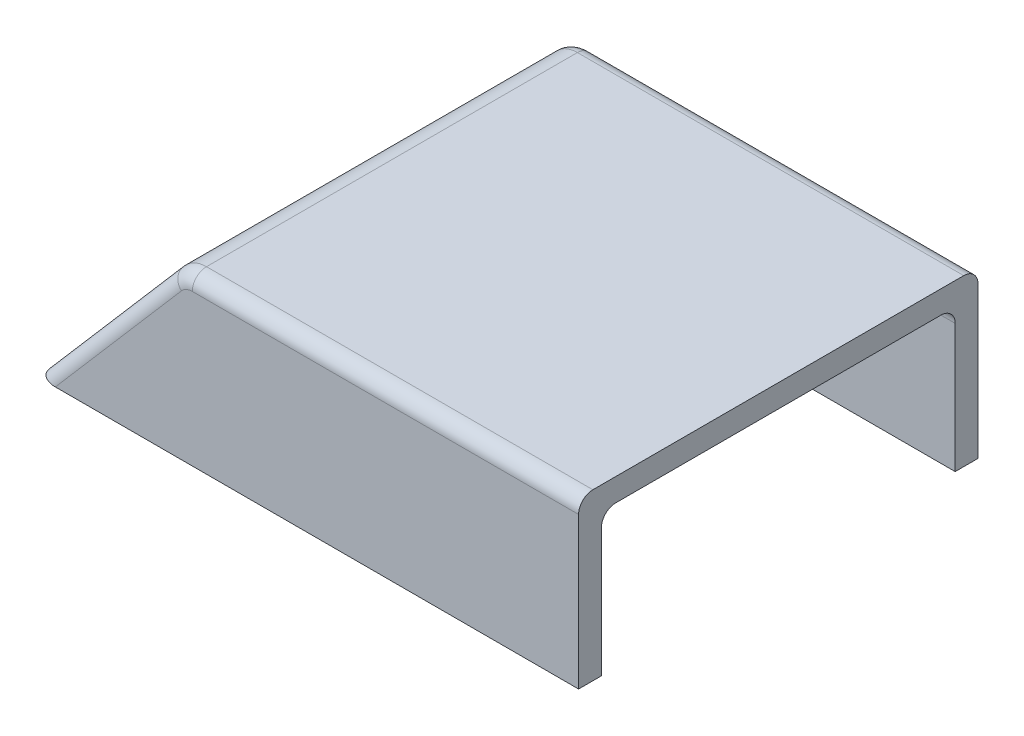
ISO-10303-21;
HEADER;
FILE_DESCRIPTION(('STEP AP214'),'2;1');
FILE_NAME('part.step','',(''),(''),'','','');
FILE_SCHEMA(('AUTOMOTIVE_DESIGN { 1 0 10303 214 1 1 1 1 }'));
ENDSEC;
DATA;
#1=APPLICATION_CONTEXT('core data for automotive mechanical design processes');
#2=APPLICATION_PROTOCOL_DEFINITION('international standard','automotive_design',2000,#1);
#3=PRODUCT_CONTEXT('',#1,'mechanical');
#4=PRODUCT('Part','Part','',(#3));
#5=PRODUCT_RELATED_PRODUCT_CATEGORY('part','',(#4));
#6=PRODUCT_DEFINITION_FORMATION('','',#4);
#7=PRODUCT_DEFINITION_CONTEXT('part definition',#1,'design');
#8=PRODUCT_DEFINITION('design','',#6,#7);
#9=PRODUCT_DEFINITION_SHAPE('','',#8);
#10=(LENGTH_UNIT() NAMED_UNIT(*) SI_UNIT(.MILLI.,.METRE.));
#11=(NAMED_UNIT(*) PLANE_ANGLE_UNIT() SI_UNIT($,.RADIAN.));
#12=(NAMED_UNIT(*) SI_UNIT($,.STERADIAN.) SOLID_ANGLE_UNIT());
#13=UNCERTAINTY_MEASURE_WITH_UNIT(LENGTH_MEASURE(1.E-05),#10,'distance_accuracy_value','');
#14=(GEOMETRIC_REPRESENTATION_CONTEXT(3) GLOBAL_UNCERTAINTY_ASSIGNED_CONTEXT((#13)) GLOBAL_UNIT_ASSIGNED_CONTEXT((#10,
#11,#12)) REPRESENTATION_CONTEXT('',''));
#15=CARTESIAN_POINT('',(0.,0.,0.));
#16=DIRECTION('',(0.,0.,1.));
#17=DIRECTION('',(1.,0.,0.));
#18=AXIS2_PLACEMENT_3D('',#15,#16,#17);
#19=CARTESIAN_POINT('',(-50.,-58.,70.));
#20=DIRECTION('',(0.757409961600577,-0.652939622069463,0.));
#21=DIRECTION('',(0.652939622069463,0.757409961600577,0.));
#22=AXIS2_PLACEMENT_3D('',#19,#20,#21);
#23=PLANE('',#22);
#24=DIRECTION('',(0.,0.,-1.));
#25=VECTOR('',#24,1.);
#26=CARTESIAN_POINT('',(-2.99189980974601,-3.47060377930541,70.));
#27=LINE('',#26,#25);
#28=CARTESIAN_POINT('',(-2.99189980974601,-3.47060377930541,65.));
#29=VERTEX_POINT('',#28);
#30=CARTESIAN_POINT('',(-2.99189980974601,-3.47060377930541,-65.));
#31=VERTEX_POINT('',#30);
#32=EDGE_CURVE('E289',#29,#31,#27,.T.);
#33=ORIENTED_EDGE('',*,*,#32,.T.);
#34=DIRECTION('',(-0.652939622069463,-0.757409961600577,0.));
#35=VECTOR('',#34,1.);
#36=CARTESIAN_POINT('',(-50.,-58.,-65.));
#37=LINE('',#36,#35);
#38=CARTESIAN_POINT('',(-50.,-58.,-65.));
#39=VERTEX_POINT('',#38);
#40=EDGE_CURVE('E275',#31,#39,#37,.T.);
#41=ORIENTED_EDGE('',*,*,#40,.T.);
#42=DIRECTION('',(0.,0.,-1.));
#43=VECTOR('',#42,1.);
#44=CARTESIAN_POINT('',(-50.,-58.,70.));
#45=LINE('',#44,#43);
#46=CARTESIAN_POINT('',(-50.,-58.,65.));
#47=VERTEX_POINT('',#46);
#48=EDGE_CURVE('E292',#47,#39,#45,.T.);
#49=ORIENTED_EDGE('',*,*,#48,.F.);
#50=DIRECTION('',(-0.652939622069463,-0.757409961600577,0.));
#51=VECTOR('',#50,1.);
#52=CARTESIAN_POINT('',(-50.,-58.,65.));
#53=LINE('',#52,#51);
#54=EDGE_CURVE('E273',#47,#29,#53,.F.);
#55=ORIENTED_EDGE('',*,*,#54,.T.);
#56=EDGE_LOOP('',(#33,#41,#49,#55));
#57=FACE_BOUND('',#56,.T.);
#58=ADVANCED_FACE('F41',(#57),#23,.F.);
#59=CARTESIAN_POINT('',(140.,-58.,70.));
#60=DIRECTION('',(0.,1.,0.));
#61=DIRECTION('',(-1.,0.,0.));
#62=AXIS2_PLACEMENT_3D('',#59,#60,#61);
#63=PLANE('',#62);
#64=ORIENTED_EDGE('',*,*,#48,.T.);
#65=CARTESIAN_POINT('',(-43.3985552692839,-58.,-65.));
#66=DIRECTION('',(0.,1.,0.));
#67=DIRECTION('',(-1.,0.,0.));
#68=AXIS2_PLACEMENT_3D('',#65,#66,#67);
#69=ELLIPSE('',#68,6.60144473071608,5.);
#70=CARTESIAN_POINT('',(-43.3985552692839,-58.,-70.));
#71=VERTEX_POINT('',#70);
#72=EDGE_CURVE('E324',#39,#71,#69,.F.);
#73=ORIENTED_EDGE('',*,*,#72,.T.);
#74=DIRECTION('',(1.,0.,0.));
#75=VECTOR('',#74,1.);
#76=CARTESIAN_POINT('',(-50.,-58.,-70.));
#77=LINE('',#76,#75);
#78=CARTESIAN_POINT('',(140.,-58.,-70.));
#79=VERTEX_POINT('',#78);
#80=EDGE_CURVE('E177',#71,#79,#77,.T.);
#81=ORIENTED_EDGE('',*,*,#80,.T.);
#82=DIRECTION('',(0.,0.,1.));
#83=VECTOR('',#82,1.);
#84=CARTESIAN_POINT('',(140.,-58.,-70.));
#85=LINE('',#84,#83);
#86=CARTESIAN_POINT('',(140.,-58.,-62.));
#87=VERTEX_POINT('',#86);
#88=EDGE_CURVE('E173',#79,#87,#85,.T.);
#89=ORIENTED_EDGE('',*,*,#88,.T.);
#90=DIRECTION('',(1.,0.,0.));
#91=VECTOR('',#90,1.);
#92=CARTESIAN_POINT('',(-50.,-58.,-62.));
#93=LINE('',#92,#91);
#94=CARTESIAN_POINT('',(-32.8362437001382,-58.,-62.));
#95=VERTEX_POINT('',#94);
#96=EDGE_CURVE('E160',#95,#87,#93,.T.);
#97=ORIENTED_EDGE('',*,*,#96,.F.);
#98=CARTESIAN_POINT('',(-32.8362437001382,-58.,-57.0000000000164));
#99=DIRECTION('',(0.,1.,0.));
#100=DIRECTION('',(1.,0.,0.));
#101=AXIS2_PLACEMENT_3D('',#98,#99,#100);
#102=ELLIPSE('',#101,6.60144473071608,5.);
#103=CARTESIAN_POINT('',(-39.4376884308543,-58.,-57.0000000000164));
#104=VERTEX_POINT('',#103);
#105=EDGE_CURVE('E205',#95,#104,#102,.T.);
#106=ORIENTED_EDGE('',*,*,#105,.T.);
#107=DIRECTION('',(0.,0.,-1.));
#108=VECTOR('',#107,1.);
#109=CARTESIAN_POINT('',(-39.4376884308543,-58.0000000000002,500000.));
#110=LINE('',#109,#108);
#111=CARTESIAN_POINT('',(-39.4376884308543,-58.,57.0000000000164));
#112=VERTEX_POINT('',#111);
#113=EDGE_CURVE('E179',#112,#104,#110,.T.);
#114=ORIENTED_EDGE('',*,*,#113,.F.);
#115=CARTESIAN_POINT('',(-32.8362437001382,-58.,57.0000000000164));
#116=DIRECTION('',(0.,1.,0.));
#117=DIRECTION('',(-1.,0.,0.));
#118=AXIS2_PLACEMENT_3D('',#115,#116,#117);
#119=ELLIPSE('',#118,6.60144473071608,5.);
#120=CARTESIAN_POINT('',(-32.8362437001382,-58.,62.));
#121=VERTEX_POINT('',#120);
#122=EDGE_CURVE('E208',#112,#121,#119,.T.);
#123=ORIENTED_EDGE('',*,*,#122,.T.);
#124=DIRECTION('',(1.,0.,0.));
#125=VECTOR('',#124,1.);
#126=CARTESIAN_POINT('',(140.,-58.,62.));
#127=LINE('',#126,#125);
#128=CARTESIAN_POINT('',(140.,-58.,62.));
#129=VERTEX_POINT('',#128);
#130=EDGE_CURVE('E216',#121,#129,#127,.T.);
#131=ORIENTED_EDGE('',*,*,#130,.T.);
#132=DIRECTION('',(0.,0.,-1.));
#133=VECTOR('',#132,1.);
#134=CARTESIAN_POINT('',(140.,-58.,70.));
#135=LINE('',#134,#133);
#136=CARTESIAN_POINT('',(140.,-58.,70.));
#137=VERTEX_POINT('',#136);
#138=EDGE_CURVE('E294',#137,#129,#135,.T.);
#139=ORIENTED_EDGE('',*,*,#138,.F.);
#140=DIRECTION('',(1.,0.,0.));
#141=VECTOR('',#140,1.);
#142=CARTESIAN_POINT('',(140.,-58.,70.));
#143=LINE('',#142,#141);
#144=CARTESIAN_POINT('',(-43.3985552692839,-58.,70.));
#145=VERTEX_POINT('',#144);
#146=EDGE_CURVE('E285',#145,#137,#143,.T.);
#147=ORIENTED_EDGE('',*,*,#146,.F.);
#148=CARTESIAN_POINT('',(-43.3985552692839,-58.,65.));
#149=DIRECTION('',(0.,1.,0.));
#150=DIRECTION('',(-1.,0.,0.));
#151=AXIS2_PLACEMENT_3D('',#148,#149,#150);
#152=ELLIPSE('',#151,6.60144473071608,5.);
#153=EDGE_CURVE('E277',#145,#47,#152,.F.);
#154=ORIENTED_EDGE('',*,*,#153,.T.);
#155=EDGE_LOOP('',(#64,#73,#81,#89,#97,#106,#114,#123,#131,#139,#147,#154));
#156=FACE_BOUND('',#155,.T.);
#157=ADVANCED_FACE('F175',(#156),#63,.F.);
#158=CARTESIAN_POINT('',(140.,-1.11022302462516E-13,70.));
#159=DIRECTION('',(-1.,0.,0.));
#160=DIRECTION('',(0.,0.,1.));
#161=AXIS2_PLACEMENT_3D('',#158,#159,#160);
#162=PLANE('',#161);
#163=DIRECTION('',(0.,1.,0.));
#164=VECTOR('',#163,1.);
#165=CARTESIAN_POINT('',(140.,-58.,-70.));
#166=LINE('',#165,#164);
#167=CARTESIAN_POINT('',(140.,-5.00000000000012,-70.));
#168=VERTEX_POINT('',#167);
#169=EDGE_CURVE('E180',#79,#168,#166,.T.);
#170=ORIENTED_EDGE('',*,*,#169,.T.);
#171=CARTESIAN_POINT('',(140.,-5.,-65.));
#172=DIRECTION('',(-1.,0.,0.));
#173=DIRECTION('',(0.,0.,1.));
#174=AXIS2_PLACEMENT_3D('',#171,#172,#173);
#175=CIRCLE('',#174,5.);
#176=CARTESIAN_POINT('',(140.,0.,-65.));
#177=VERTEX_POINT('',#176);
#178=EDGE_CURVE('E55',#168,#177,#175,.F.);
#179=ORIENTED_EDGE('',*,*,#178,.T.);
#180=DIRECTION('',(0.,0.,-1.));
#181=VECTOR('',#180,1.);
#182=CARTESIAN_POINT('',(140.,-1.11022302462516E-13,70.));
#183=LINE('',#182,#181);
#184=CARTESIAN_POINT('',(140.,-1.11022302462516E-13,65.));
#185=VERTEX_POINT('',#184);
#186=EDGE_CURVE('E296',#185,#177,#183,.T.);
#187=ORIENTED_EDGE('',*,*,#186,.F.);
#188=CARTESIAN_POINT('',(140.,-5.00000000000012,65.));
#189=DIRECTION('',(-1.,0.,0.));
#190=DIRECTION('',(0.,0.,1.));
#191=AXIS2_PLACEMENT_3D('',#188,#189,#190);
#192=CIRCLE('',#191,5.);
#193=CARTESIAN_POINT('',(140.,-5.00000000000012,70.));
#194=VERTEX_POINT('',#193);
#195=EDGE_CURVE('E206',#185,#194,#192,.F.);
#196=ORIENTED_EDGE('',*,*,#195,.T.);
#197=DIRECTION('',(0.,1.,0.));
#198=VECTOR('',#197,1.);
#199=CARTESIAN_POINT('',(140.,-1.11022302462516E-13,70.));
#200=LINE('',#199,#198);
#201=EDGE_CURVE('E297',#137,#194,#200,.T.);
#202=ORIENTED_EDGE('',*,*,#201,.F.);
#203=ORIENTED_EDGE('',*,*,#138,.T.);
#204=DIRECTION('',(0.,1.,0.));
#205=VECTOR('',#204,1.);
#206=CARTESIAN_POINT('',(140.,-1.11022302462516E-13,62.));
#207=LINE('',#206,#205);
#208=CARTESIAN_POINT('',(140.,-13.0000000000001,62.));
#209=VERTEX_POINT('',#208);
#210=EDGE_CURVE('E229',#129,#209,#207,.T.);
#211=ORIENTED_EDGE('',*,*,#210,.T.);
#212=CARTESIAN_POINT('',(140.,-13.0000000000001,57.0000000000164));
#213=DIRECTION('',(-1.,0.,0.));
#214=DIRECTION('',(0.,0.,1.));
#215=AXIS2_PLACEMENT_3D('',#212,#213,#214);
#216=CIRCLE('',#215,5.);
#217=CARTESIAN_POINT('',(140.,-8.00000000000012,57.0000000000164));
#218=VERTEX_POINT('',#217);
#219=EDGE_CURVE('E11',#209,#218,#216,.T.);
#220=ORIENTED_EDGE('',*,*,#219,.T.);
#221=DIRECTION('',(0.,0.,-1.));
#222=VECTOR('',#221,1.);
#223=CARTESIAN_POINT('',(140.,-8.00000000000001,500000.));
#224=LINE('',#223,#222);
#225=CARTESIAN_POINT('',(140.,-8.00000000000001,-57.0000000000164));
#226=VERTEX_POINT('',#225);
#227=EDGE_CURVE('E230',#218,#226,#224,.T.);
#228=ORIENTED_EDGE('',*,*,#227,.T.);
#229=CARTESIAN_POINT('',(140.,-13.,-57.0000000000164));
#230=DIRECTION('',(-1.,0.,0.));
#231=DIRECTION('',(0.,0.,1.));
#232=AXIS2_PLACEMENT_3D('',#229,#230,#231);
#233=CIRCLE('',#232,5.);
#234=CARTESIAN_POINT('',(140.,-13.0000000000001,-62.));
#235=VERTEX_POINT('',#234);
#236=EDGE_CURVE('E48',#226,#235,#233,.T.);
#237=ORIENTED_EDGE('',*,*,#236,.T.);
#238=DIRECTION('',(0.,1.,0.));
#239=VECTOR('',#238,1.);
#240=CARTESIAN_POINT('',(140.,-58.,-62.));
#241=LINE('',#240,#239);
#242=EDGE_CURVE('E164',#87,#235,#241,.T.);
#243=ORIENTED_EDGE('',*,*,#242,.F.);
#244=ORIENTED_EDGE('',*,*,#88,.F.);
#245=EDGE_LOOP('',(#170,#179,#187,#196,#202,#203,#211,#220,#228,#237,#243,#244));
#246=FACE_BOUND('',#245,.T.);
#247=ADVANCED_FACE('F182',(#246),#162,.F.);
#248=CARTESIAN_POINT('',(0.,-1.11022302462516E-13,70.));
#249=DIRECTION('',(0.,-1.,0.));
#250=DIRECTION('',(0.,0.,-1.));
#251=AXIS2_PLACEMENT_3D('',#248,#249,#250);
#252=PLANE('',#251);
#253=ORIENTED_EDGE('',*,*,#186,.T.);
#254=DIRECTION('',(-1.,0.,0.));
#255=VECTOR('',#254,1.);
#256=CARTESIAN_POINT('',(0.,0.,-65.));
#257=LINE('',#256,#255);
#258=CARTESIAN_POINT('',(4.58219980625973,0.,-65.));
#259=VERTEX_POINT('',#258);
#260=EDGE_CURVE('E204',#177,#259,#257,.T.);
#261=ORIENTED_EDGE('',*,*,#260,.T.);
#262=DIRECTION('',(0.,0.,-1.));
#263=VECTOR('',#262,1.);
#264=CARTESIAN_POINT('',(4.58219980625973,-1.11022302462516E-13,70.));
#265=LINE('',#264,#263);
#266=CARTESIAN_POINT('',(4.58219980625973,-1.11022302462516E-13,65.));
#267=VERTEX_POINT('',#266);
#268=EDGE_CURVE('E263',#259,#267,#265,.F.);
#269=ORIENTED_EDGE('',*,*,#268,.T.);
#270=DIRECTION('',(-1.,0.,0.));
#271=VECTOR('',#270,1.);
#272=CARTESIAN_POINT('',(0.,-1.11022302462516E-13,65.));
#273=LINE('',#272,#271);
#274=EDGE_CURVE('E62',#267,#185,#273,.F.);
#275=ORIENTED_EDGE('',*,*,#274,.T.);
#276=EDGE_LOOP('',(#253,#261,#269,#275));
#277=FACE_BOUND('',#276,.T.);
#278=ADVANCED_FACE('F372',(#277),#252,.F.);
#279=CARTESIAN_POINT('',(0.,-1.11022302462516E-13,70.));
#280=DIRECTION('',(0.,0.,-1.));
#281=DIRECTION('',(-1.,0.,0.));
#282=AXIS2_PLACEMENT_3D('',#279,#280,#281);
#283=PLANE('',#282);
#284=CARTESIAN_POINT('',(4.58219980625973,-10.0000000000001,70.));
#285=DIRECTION('',(0.,0.,-1.));
#286=DIRECTION('',(-1.,0.,0.));
#287=AXIS2_PLACEMENT_3D('',#284,#285,#286);
#288=CIRCLE('',#287,5.);
#289=CARTESIAN_POINT('',(4.58219980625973,-5.00000000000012,70.));
#290=VERTEX_POINT('',#289);
#291=CARTESIAN_POINT('',(0.795149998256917,-6.73530188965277,70.));
#292=VERTEX_POINT('',#291);
#293=EDGE_CURVE('E239',#290,#292,#288,.F.);
#294=ORIENTED_EDGE('',*,*,#293,.T.);
#295=DIRECTION('',(-0.652939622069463,-0.757409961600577,0.));
#296=VECTOR('',#295,1.);
#297=CARTESIAN_POINT('',(3.78704980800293,-3.26469811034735,70.));
#298=LINE('',#297,#296);
#299=EDGE_CURVE('E246',#292,#145,#298,.T.);
#300=ORIENTED_EDGE('',*,*,#299,.T.);
#301=ORIENTED_EDGE('',*,*,#146,.T.);
#302=ORIENTED_EDGE('',*,*,#201,.T.);
#303=DIRECTION('',(-1.,0.,0.));
#304=VECTOR('',#303,1.);
#305=CARTESIAN_POINT('',(0.,-5.00000000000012,70.));
#306=LINE('',#305,#304);
#307=EDGE_CURVE('E236',#194,#290,#306,.T.);
#308=ORIENTED_EDGE('',*,*,#307,.T.);
#309=EDGE_LOOP('',(#294,#300,#301,#302,#308));
#310=FACE_BOUND('',#309,.T.);
#311=ADVANCED_FACE('F303',(#310),#283,.F.);
#312=CARTESIAN_POINT('',(0.,-1.11022302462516E-13,62.));
#313=DIRECTION('',(0.,0.,-1.));
#314=DIRECTION('',(-1.,0.,0.));
#315=AXIS2_PLACEMENT_3D('',#312,#313,#314);
#316=PLANE('',#315);
#317=ORIENTED_EDGE('',*,*,#130,.F.);
#318=DIRECTION('',(-0.652939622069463,-0.757409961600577,0.));
#319=VECTOR('',#318,1.);
#320=CARTESIAN_POINT('',(9.84632950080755,-8.48821508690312,62.));
#321=LINE('',#320,#319);
#322=CARTESIAN_POINT('',(5.95685974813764,-13.0000000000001,62.));
#323=VERTEX_POINT('',#322);
#324=EDGE_CURVE('E226',#121,#323,#321,.F.);
#325=ORIENTED_EDGE('',*,*,#324,.T.);
#326=DIRECTION('',(-1.,0.,0.));
#327=VECTOR('',#326,1.);
#328=CARTESIAN_POINT('',(0.,-13.0000000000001,62.));
#329=LINE('',#328,#327);
#330=EDGE_CURVE('E237',#323,#209,#329,.F.);
#331=ORIENTED_EDGE('',*,*,#330,.T.);
#332=ORIENTED_EDGE('',*,*,#210,.F.);
#333=EDGE_LOOP('',(#317,#325,#331,#332));
#334=FACE_BOUND('',#333,.T.);
#335=ADVANCED_FACE('F225',(#334),#316,.T.);
#336=CARTESIAN_POINT('',(4.58219980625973,-10.0000000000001,70.));
#337=DIRECTION('',(0.,0.,-1.));
#338=DIRECTION('',(-1.,0.,0.));
#339=AXIS2_PLACEMENT_3D('',#336,#337,#338);
#340=CYLINDRICAL_SURFACE('',#339,10.);
#341=ORIENTED_EDGE('',*,*,#268,.F.);
#342=CARTESIAN_POINT('',(4.58219980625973,-10.,-65.));
#343=DIRECTION('',(0.,0.,1.));
#344=DIRECTION('',(1.,0.,0.));
#345=AXIS2_PLACEMENT_3D('',#342,#343,#344);
#346=CIRCLE('',#345,10.);
#347=EDGE_CURVE('E241',#259,#31,#346,.T.);
#348=ORIENTED_EDGE('',*,*,#347,.T.);
#349=ORIENTED_EDGE('',*,*,#32,.F.);
#350=CARTESIAN_POINT('',(4.58219980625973,-10.0000000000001,65.));
#351=DIRECTION('',(0.,0.,-1.));
#352=DIRECTION('',(-1.,0.,0.));
#353=AXIS2_PLACEMENT_3D('',#350,#351,#352);
#354=CIRCLE('',#353,10.);
#355=EDGE_CURVE('E318',#29,#267,#354,.T.);
#356=ORIENTED_EDGE('',*,*,#355,.T.);
#357=EDGE_LOOP('',(#341,#348,#349,#356));
#358=FACE_BOUND('',#357,.T.);
#359=ADVANCED_FACE('F335',(#358),#340,.T.);
#360=CARTESIAN_POINT('',(3.06737988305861,-8.69412075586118,500000.));
#361=DIRECTION('',(-0.757409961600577,0.652939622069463,0.));
#362=DIRECTION('',(-0.652939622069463,-0.757409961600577,0.));
#363=AXIS2_PLACEMENT_3D('',#360,#361,#362);
#364=PLANE('',#363);
#365=ORIENTED_EDGE('',*,*,#113,.T.);
#366=DIRECTION('',(0.652939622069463,0.757409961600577,0.));
#367=VECTOR('',#366,1.);
#368=CARTESIAN_POINT('',(3.06737988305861,-8.69412075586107,-57.0000000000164));
#369=LINE('',#368,#367);
#370=CARTESIAN_POINT('',(3.06737988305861,-8.69412075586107,-57.0000000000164));
#371=VERTEX_POINT('',#370);
#372=EDGE_CURVE('E262',#104,#371,#369,.T.);
#373=ORIENTED_EDGE('',*,*,#372,.T.);
#374=DIRECTION('',(0.,0.,-1.));
#375=VECTOR('',#374,1.);
#376=CARTESIAN_POINT('',(3.06737988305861,-8.69412075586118,500000.));
#377=LINE('',#376,#375);
#378=CARTESIAN_POINT('',(3.06737988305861,-8.69412075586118,57.0000000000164));
#379=VERTEX_POINT('',#378);
#380=EDGE_CURVE('E190',#379,#371,#377,.T.);
#381=ORIENTED_EDGE('',*,*,#380,.F.);
#382=DIRECTION('',(-0.652939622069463,-0.757409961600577,0.));
#383=VECTOR('',#382,1.);
#384=CARTESIAN_POINT('',(3.06737988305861,-8.69412075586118,57.0000000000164));
#385=LINE('',#384,#383);
#386=EDGE_CURVE('E260',#379,#112,#385,.T.);
#387=ORIENTED_EDGE('',*,*,#386,.T.);
#388=EDGE_LOOP('',(#365,#373,#381,#387));
#389=FACE_BOUND('',#388,.T.);
#390=ADVANCED_FACE('F363',(#389),#364,.F.);
#391=CARTESIAN_POINT('',(4.58219980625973,-10.0000000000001,500000.));
#392=DIRECTION('',(0.,0.,-1.));
#393=DIRECTION('',(-1.,0.,0.));
#394=AXIS2_PLACEMENT_3D('',#391,#392,#393);
#395=CYLINDRICAL_SURFACE('',#394,1.99999999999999);
#396=ORIENTED_EDGE('',*,*,#380,.T.);
#397=CARTESIAN_POINT('',(4.58219980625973,-10.,-57.0000000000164));
#398=DIRECTION('',(0.,0.,-1.));
#399=DIRECTION('',(-1.,0.,0.));
#400=AXIS2_PLACEMENT_3D('',#397,#398,#399);
#401=CIRCLE('',#400,1.99999999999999);
#402=CARTESIAN_POINT('',(4.58219980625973,-8.00000000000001,-57.0000000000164));
#403=VERTEX_POINT('',#402);
#404=EDGE_CURVE('E271',#371,#403,#401,.T.);
#405=ORIENTED_EDGE('',*,*,#404,.T.);
#406=DIRECTION('',(0.,0.,-1.));
#407=VECTOR('',#406,1.);
#408=CARTESIAN_POINT('',(4.58219980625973,-8.00000000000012,500000.));
#409=LINE('',#408,#407);
#410=CARTESIAN_POINT('',(4.58219980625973,-8.00000000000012,57.0000000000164));
#411=VERTEX_POINT('',#410);
#412=EDGE_CURVE('E252',#411,#403,#409,.T.);
#413=ORIENTED_EDGE('',*,*,#412,.F.);
#414=CARTESIAN_POINT('',(4.58219980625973,-10.0000000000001,57.0000000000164));
#415=DIRECTION('',(0.,0.,1.));
#416=DIRECTION('',(1.,0.,0.));
#417=AXIS2_PLACEMENT_3D('',#414,#415,#416);
#418=CIRCLE('',#417,1.99999999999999);
#419=EDGE_CURVE('E269',#411,#379,#418,.T.);
#420=ORIENTED_EDGE('',*,*,#419,.T.);
#421=EDGE_LOOP('',(#396,#405,#413,#420));
#422=FACE_BOUND('',#421,.T.);
#423=ADVANCED_FACE('F385',(#422),#395,.F.);
#424=CARTESIAN_POINT('',(140.,-8.00000000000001,500000.));
#425=DIRECTION('',(0.,1.,0.));
#426=DIRECTION('',(-1.,0.,0.));
#427=AXIS2_PLACEMENT_3D('',#424,#425,#426);
#428=PLANE('',#427);
#429=ORIENTED_EDGE('',*,*,#412,.T.);
#430=DIRECTION('',(1.,0.,0.));
#431=VECTOR('',#430,1.);
#432=CARTESIAN_POINT('',(140.,-8.00000000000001,-57.0000000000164));
#433=LINE('',#432,#431);
#434=EDGE_CURVE('E410',#403,#226,#433,.T.);
#435=ORIENTED_EDGE('',*,*,#434,.T.);
#436=ORIENTED_EDGE('',*,*,#227,.F.);
#437=DIRECTION('',(-1.,0.,0.));
#438=VECTOR('',#437,1.);
#439=CARTESIAN_POINT('',(140.,-8.00000000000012,57.0000000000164));
#440=LINE('',#439,#438);
#441=EDGE_CURVE('E249',#218,#411,#440,.T.);
#442=ORIENTED_EDGE('',*,*,#441,.T.);
#443=EDGE_LOOP('',(#429,#435,#436,#442));
#444=FACE_BOUND('',#443,.T.);
#445=ADVANCED_FACE('F361',(#444),#428,.F.);
#446=CARTESIAN_POINT('',(140.,-58.,-62.));
#447=DIRECTION('',(0.,0.,1.));
#448=DIRECTION('',(1.,0.,0.));
#449=AXIS2_PLACEMENT_3D('',#446,#447,#448);
#450=PLANE('',#449);
#451=DIRECTION('',(1.,0.,0.));
#452=VECTOR('',#451,1.);
#453=CARTESIAN_POINT('',(140.,-13.,-62.));
#454=LINE('',#453,#452);
#455=CARTESIAN_POINT('',(5.95685974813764,-13.,-62.));
#456=VERTEX_POINT('',#455);
#457=EDGE_CURVE('E265',#235,#456,#454,.F.);
#458=ORIENTED_EDGE('',*,*,#457,.T.);
#459=DIRECTION('',(0.652939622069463,0.757409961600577,0.));
#460=VECTOR('',#459,1.);
#461=CARTESIAN_POINT('',(40.8490580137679,27.4749499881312,-62.));
#462=LINE('',#461,#460);
#463=EDGE_CURVE('E167',#456,#95,#462,.F.);
#464=ORIENTED_EDGE('',*,*,#463,.T.);
#465=ORIENTED_EDGE('',*,*,#96,.T.);
#466=ORIENTED_EDGE('',*,*,#242,.T.);
#467=EDGE_LOOP('',(#458,#464,#465,#466));
#468=FACE_BOUND('',#467,.T.);
#469=ADVANCED_FACE('F162',(#468),#450,.T.);
#470=CARTESIAN_POINT('',(140.,-58.,-70.));
#471=DIRECTION('',(0.,0.,1.));
#472=DIRECTION('',(1.,0.,0.));
#473=AXIS2_PLACEMENT_3D('',#470,#471,#472);
#474=PLANE('',#473);
#475=ORIENTED_EDGE('',*,*,#80,.F.);
#476=DIRECTION('',(-0.652939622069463,-0.757409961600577,0.));
#477=VECTOR('',#476,1.);
#478=CARTESIAN_POINT('',(34.7897783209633,32.6984669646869,-70.));
#479=LINE('',#478,#477);
#480=CARTESIAN_POINT('',(0.795149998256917,-6.73530188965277,-70.));
#481=VERTEX_POINT('',#480);
#482=EDGE_CURVE('E329',#71,#481,#479,.F.);
#483=ORIENTED_EDGE('',*,*,#482,.T.);
#484=CARTESIAN_POINT('',(4.58219980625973,-10.,-70.));
#485=DIRECTION('',(0.,0.,1.));
#486=DIRECTION('',(1.,0.,0.));
#487=AXIS2_PLACEMENT_3D('',#484,#485,#486);
#488=CIRCLE('',#487,5.);
#489=CARTESIAN_POINT('',(4.58219980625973,-5.,-70.));
#490=VERTEX_POINT('',#489);
#491=EDGE_CURVE('E325',#481,#490,#488,.F.);
#492=ORIENTED_EDGE('',*,*,#491,.T.);
#493=DIRECTION('',(-1.,0.,0.));
#494=VECTOR('',#493,1.);
#495=CARTESIAN_POINT('',(140.,-5.,-70.));
#496=LINE('',#495,#494);
#497=EDGE_CURVE('E202',#490,#168,#496,.F.);
#498=ORIENTED_EDGE('',*,*,#497,.T.);
#499=ORIENTED_EDGE('',*,*,#169,.F.);
#500=EDGE_LOOP('',(#475,#483,#492,#498,#499));
#501=FACE_BOUND('',#500,.T.);
#502=ADVANCED_FACE('F350',(#501),#474,.F.);
#503=CARTESIAN_POINT('',(140.,-13.,-57.0000000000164));
#504=DIRECTION('',(1.,0.,0.));
#505=DIRECTION('',(0.,1.,0.));
#506=AXIS2_PLACEMENT_3D('',#503,#504,#505);
#507=CYLINDRICAL_SURFACE('',#506,5.);
#508=ORIENTED_EDGE('',*,*,#236,.F.);
#509=ORIENTED_EDGE('',*,*,#434,.F.);
#510=CARTESIAN_POINT('',(5.95685974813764,-13.,-57.0000000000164));
#511=DIRECTION('',(-0.964222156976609,-0.265095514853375,0.));
#512=DIRECTION('',(-0.265095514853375,0.964222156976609,0.));
#513=AXIS2_PLACEMENT_3D('',#510,#511,#512);
#514=ELLIPSE('',#513,5.18552696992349,5.);
#515=EDGE_CURVE('E170',#456,#403,#514,.F.);
#516=ORIENTED_EDGE('',*,*,#515,.F.);
#517=ORIENTED_EDGE('',*,*,#457,.F.);
#518=EDGE_LOOP('',(#508,#509,#516,#517));
#519=FACE_BOUND('',#518,.T.);
#520=ADVANCED_FACE('F352',(#519),#507,.F.);
#521=CARTESIAN_POINT('',(5.9568597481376,-13.,-62.0000000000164));
#522=CARTESIAN_POINT('',(5.9568597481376,-13.,-62.0000000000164));
#523=CARTESIAN_POINT('',(5.95685974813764,-13.,-62.0000000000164));
#524=CARTESIAN_POINT('',(5.83085139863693,-12.8122233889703,-62.0000296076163));
#525=CARTESIAN_POINT('',(5.86387568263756,-12.7970754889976,-62.0000170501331));
#526=CARTESIAN_POINT('',(5.89691171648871,-12.7819532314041,-62.0000296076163));
#527=CARTESIAN_POINT('',(5.70483132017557,-12.6244292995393,-61.9857369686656));
#528=CARTESIAN_POINT('',(5.77080125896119,-12.5939537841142,-61.9877099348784));
#529=CARTESIAN_POINT('',(5.83695810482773,-12.5638861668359,-61.9857369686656));
#530=CARTESIAN_POINT('',(5.45495013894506,-12.2520584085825,-61.9287954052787));
#531=CARTESIAN_POINT('',(5.58583997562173,-12.1903020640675,-61.938521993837));
#532=CARTESIAN_POINT('',(5.71807800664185,-12.1314879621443,-61.9287954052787));
#533=CARTESIAN_POINT('',(5.33108378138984,-12.0674737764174,-61.8862299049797));
#534=CARTESIAN_POINT('',(5.49377401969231,-11.9893811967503,-61.9016177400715));
#535=CARTESIAN_POINT('',(5.65914902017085,-11.9171477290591,-61.8862299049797));
#536=CARTESIAN_POINT('',(5.08762873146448,-11.7046790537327,-61.7733519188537));
#537=CARTESIAN_POINT('',(5.31186711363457,-11.5923952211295,-61.8031754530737));
#538=CARTESIAN_POINT('',(5.5433261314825,-11.4958693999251,-61.7733519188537));
#539=CARTESIAN_POINT('',(4.96801963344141,-11.5264385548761,-61.7031994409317));
#540=CARTESIAN_POINT('',(5.22185818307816,-11.3959635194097,-61.741595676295));
#541=CARTESIAN_POINT('',(5.48642252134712,-11.2888959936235,-61.7031994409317));
#542=CARTESIAN_POINT('',(4.73514500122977,-11.1794106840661,-61.5362820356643));
#543=CARTESIAN_POINT('',(5.0451708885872,-11.0103686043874,-61.5937641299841));
#544=CARTESIAN_POINT('',(5.37563322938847,-10.8859261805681,-61.5362820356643));
#545=CARTESIAN_POINT('',(4.62183554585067,-11.0105578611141,-61.4397397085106));
#546=CARTESIAN_POINT('',(4.9583461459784,-10.8208859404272,-61.5074646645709));
#547=CARTESIAN_POINT('',(5.32172665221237,-10.6898537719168,-61.4397397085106));
#548=CARTESIAN_POINT('',(4.40352368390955,-10.685231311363,-61.2216328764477));
#549=CARTESIAN_POINT('',(4.7892427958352,-10.4518419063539,-61.3102219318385));
#550=CARTESIAN_POINT('',(5.21786554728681,-10.3120835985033,-61.2216328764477));
#551=CARTESIAN_POINT('',(4.2984483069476,-10.5286488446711,-61.1003337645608));
#552=CARTESIAN_POINT('',(4.70684584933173,-10.2720222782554,-61.1992422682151));
#553=CARTESIAN_POINT('',(5.16787630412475,-10.1302595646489,-61.1003337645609));
#554=CARTESIAN_POINT('',(4.09843288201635,-10.2305874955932,-60.8347524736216));
#555=CARTESIAN_POINT('',(4.54795905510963,-9.92527442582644,-60.9528728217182));
#556=CARTESIAN_POINT('',(5.07271966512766,-9.78414982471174,-60.8347524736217));
#557=CARTESIAN_POINT('',(4.00338920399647,-10.0889541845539,-60.6907538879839));
#558=CARTESIAN_POINT('',(4.47138419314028,-9.75816066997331,-60.8174809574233));
#559=CARTESIAN_POINT('',(5.02750296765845,-9.61968479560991,-60.6907538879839));
#560=CARTESIAN_POINT('',(3.82509424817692,-9.82326050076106,-60.3822270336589));
#561=CARTESIAN_POINT('',(4.32566530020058,-9.44014989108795,-60.5229170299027));
#562=CARTESIAN_POINT('',(4.9426797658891,-9.31116048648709,-60.3822270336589));
#563=CARTESIAN_POINT('',(3.74171206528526,-9.69900505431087,-60.2179736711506));
#564=CARTESIAN_POINT('',(4.25647162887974,-9.28914453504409,-60.3638034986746));
#565=CARTESIAN_POINT('',(4.90301098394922,-9.16687468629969,-60.2179736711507));
#566=CARTESIAN_POINT('',(3.5881929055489,-9.47023205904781,-59.8717660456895));
#567=CARTESIAN_POINT('',(4.12718575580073,-9.00699648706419,-60.0230734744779));
#568=CARTESIAN_POINT('',(4.82997478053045,-8.90122279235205,-59.8717660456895));
#569=CARTESIAN_POINT('',(3.51790670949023,-9.36549214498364,-59.6900522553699));
#570=CARTESIAN_POINT('',(4.06707724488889,-8.87581820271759,-59.8416023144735));
#571=CARTESIAN_POINT('',(4.79653636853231,-8.77959848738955,-59.6900522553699));
#572=CARTESIAN_POINT('',(3.39179753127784,-9.17756527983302,-59.3120777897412));
#573=CARTESIAN_POINT('',(3.95771001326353,-8.63713975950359,-59.4583534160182));
#574=CARTESIAN_POINT('',(4.73654036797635,-8.56137724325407,-59.3120777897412));
#575=CARTESIAN_POINT('',(3.33582127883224,-9.09414992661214,-59.1160029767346));
#576=CARTESIAN_POINT('',(3.90846149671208,-8.52966186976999,-59.2568281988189));
#577=CARTESIAN_POINT('',(4.70990986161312,-8.46451508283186,-59.1160029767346));
#578=CARTESIAN_POINT('',(3.23928905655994,-8.95029839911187,-58.712725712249));
#579=CARTESIAN_POINT('',(3.82250637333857,-8.34207702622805,-58.8368082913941));
#580=CARTESIAN_POINT('',(4.66398499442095,-8.29747425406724,-58.7127257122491));
#581=CARTESIAN_POINT('',(3.19859378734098,-8.88965464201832,-58.5056444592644));
#582=CARTESIAN_POINT('',(3.78582538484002,-8.26202598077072,-58.6186811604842));
#583=CARTESIAN_POINT('',(4.64462436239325,-8.22705453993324,-58.5056444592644));
#584=CARTESIAN_POINT('',(3.1332996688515,-8.7923538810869,-58.083969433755));
#585=CARTESIAN_POINT('',(3.72645095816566,-8.13244973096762,-58.1700082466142));
#586=CARTESIAN_POINT('',(4.61356091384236,-8.11406860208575,-58.083969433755));
#587=CARTESIAN_POINT('',(3.10859435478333,-8.755538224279,-57.8694355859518));
#588=CARTESIAN_POINT('',(3.7037851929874,-8.08298491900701,-57.9399345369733));
#589=CARTESIAN_POINT('',(4.60180744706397,-8.07131815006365,-57.8694355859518));
#590=CARTESIAN_POINT('',(3.07566335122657,-8.70646471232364,-57.4365905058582));
#591=CARTESIAN_POINT('',(3.67343088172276,-8.01674094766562,-57.472972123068));
#592=CARTESIAN_POINT('',(4.58614063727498,-8.0143338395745,-57.4365905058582));
#593=CARTESIAN_POINT('',(3.06737988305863,-8.69412075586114,-57.2182952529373));
#594=CARTESIAN_POINT('',(3.66575984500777,-8.00000000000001,-57.2366291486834));
#595=CARTESIAN_POINT('',(4.58219980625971,-8.00000000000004,-57.2182952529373));
#596=CARTESIAN_POINT('',(3.06737988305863,-8.69412075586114,-56.7817047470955));
#597=CARTESIAN_POINT('',(3.66575984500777,-8.00000000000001,-56.7633708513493));
#598=CARTESIAN_POINT('',(4.58219980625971,-8.00000000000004,-56.7817047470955));
#599=CARTESIAN_POINT('',(3.07566335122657,-8.70646471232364,-56.5634094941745));
#600=CARTESIAN_POINT('',(3.67343088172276,-8.01674094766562,-56.5270278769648));
#601=CARTESIAN_POINT('',(4.58614063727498,-8.0143338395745,-56.5634094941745));
#602=CARTESIAN_POINT('',(3.10859435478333,-8.755538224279,-56.130564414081));
#603=CARTESIAN_POINT('',(3.7037851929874,-8.08298491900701,-56.0600654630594));
#604=CARTESIAN_POINT('',(4.60180744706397,-8.07131815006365,-56.130564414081));
#605=CARTESIAN_POINT('',(3.1332996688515,-8.7923538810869,-55.9160305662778));
#606=CARTESIAN_POINT('',(3.72645095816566,-8.13244973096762,-55.8299917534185));
#607=CARTESIAN_POINT('',(4.61356091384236,-8.11406860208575,-55.9160305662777));
#608=CARTESIAN_POINT('',(3.19859378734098,-8.88965464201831,-55.4943555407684));
#609=CARTESIAN_POINT('',(3.78582538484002,-8.26202598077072,-55.3813188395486));
#610=CARTESIAN_POINT('',(4.64462436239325,-8.22705453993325,-55.4943555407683));
#611=CARTESIAN_POINT('',(3.23928905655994,-8.95029839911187,-55.2872742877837));
#612=CARTESIAN_POINT('',(3.82250637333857,-8.34207702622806,-55.1631917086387));
#613=CARTESIAN_POINT('',(4.66398499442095,-8.29747425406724,-55.2872742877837));
#614=CARTESIAN_POINT('',(3.33582127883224,-9.09414992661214,-54.8839970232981));
#615=CARTESIAN_POINT('',(3.90846149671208,-8.52966186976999,-54.7431718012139));
#616=CARTESIAN_POINT('',(4.70990986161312,-8.46451508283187,-54.8839970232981));
#617=CARTESIAN_POINT('',(3.39179753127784,-9.17756527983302,-54.6879222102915));
#618=CARTESIAN_POINT('',(3.95771001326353,-8.63713975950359,-54.5416465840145));
#619=CARTESIAN_POINT('',(4.73654036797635,-8.56137724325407,-54.6879222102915));
#620=CARTESIAN_POINT('',(3.51790670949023,-9.36549214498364,-54.3099477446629));
#621=CARTESIAN_POINT('',(4.06707724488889,-8.87581820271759,-54.1583976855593));
#622=CARTESIAN_POINT('',(4.79653636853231,-8.77959848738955,-54.3099477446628));
#623=CARTESIAN_POINT('',(3.5881929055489,-9.47023205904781,-54.1282339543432));
#624=CARTESIAN_POINT('',(4.12718575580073,-9.00699648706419,-53.9769265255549));
#625=CARTESIAN_POINT('',(4.82997478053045,-8.90122279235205,-54.1282339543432));
#626=CARTESIAN_POINT('',(3.74171206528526,-9.69900505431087,-53.7820263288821));
#627=CARTESIAN_POINT('',(4.25647162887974,-9.28914453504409,-53.6361965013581));
#628=CARTESIAN_POINT('',(4.90301098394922,-9.16687468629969,-53.7820263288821));
#629=CARTESIAN_POINT('',(3.82509424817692,-9.82326050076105,-53.6177729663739));
#630=CARTESIAN_POINT('',(4.32566530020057,-9.44014989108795,-53.4770829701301));
#631=CARTESIAN_POINT('',(4.9426797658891,-9.31116048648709,-53.6177729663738));
#632=CARTESIAN_POINT('',(4.00338920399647,-10.0889541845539,-53.3092461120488));
#633=CARTESIAN_POINT('',(4.47138419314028,-9.75816066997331,-53.1825190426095));
#634=CARTESIAN_POINT('',(5.02750296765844,-9.6196847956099,-53.3092461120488));
#635=CARTESIAN_POINT('',(4.09843288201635,-10.2305874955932,-53.1652475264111));
#636=CARTESIAN_POINT('',(4.54795905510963,-9.92527442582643,-53.0471271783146));
#637=CARTESIAN_POINT('',(5.07271966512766,-9.78414982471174,-53.1652475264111));
#638=CARTESIAN_POINT('',(4.2984483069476,-10.5286488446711,-52.8996662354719));
#639=CARTESIAN_POINT('',(4.70684584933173,-10.2720222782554,-52.8007577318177));
#640=CARTESIAN_POINT('',(5.16787630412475,-10.1302595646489,-52.8996662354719));
#641=CARTESIAN_POINT('',(4.40352368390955,-10.685231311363,-52.778367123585));
#642=CARTESIAN_POINT('',(4.7892427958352,-10.4518419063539,-52.6897780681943));
#643=CARTESIAN_POINT('',(5.21786554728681,-10.3120835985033,-52.778367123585));
#644=CARTESIAN_POINT('',(4.62183554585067,-11.0105578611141,-52.5602602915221));
#645=CARTESIAN_POINT('',(4.9583461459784,-10.8208859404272,-52.4925353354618));
#646=CARTESIAN_POINT('',(5.32172665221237,-10.6898537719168,-52.5602602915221));
#647=CARTESIAN_POINT('',(4.73514500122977,-11.1794106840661,-52.4637179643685));
#648=CARTESIAN_POINT('',(5.0451708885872,-11.0103686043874,-52.4062358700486));
#649=CARTESIAN_POINT('',(5.37563322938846,-10.8859261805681,-52.4637179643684));
#650=CARTESIAN_POINT('',(4.96801963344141,-11.5264385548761,-52.2968005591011));
#651=CARTESIAN_POINT('',(5.22185818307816,-11.3959635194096,-52.2584043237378));
#652=CARTESIAN_POINT('',(5.48642252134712,-11.2888959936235,-52.296800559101));
#653=CARTESIAN_POINT('',(5.08762873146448,-11.7046790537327,-52.2266480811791));
#654=CARTESIAN_POINT('',(5.31186711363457,-11.5923952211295,-52.196824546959));
#655=CARTESIAN_POINT('',(5.54332613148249,-11.4958693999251,-52.2266480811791));
#656=CARTESIAN_POINT('',(5.33108378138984,-12.0674737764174,-52.113770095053));
#657=CARTESIAN_POINT('',(5.49377401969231,-11.9893811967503,-52.0983822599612));
#658=CARTESIAN_POINT('',(5.65914902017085,-11.9171477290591,-52.113770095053));
#659=CARTESIAN_POINT('',(5.45495013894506,-12.2520584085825,-52.0712045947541));
#660=CARTESIAN_POINT('',(5.58583997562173,-12.1903020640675,-52.0614780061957));
#661=CARTESIAN_POINT('',(5.71807800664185,-12.1314879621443,-52.071204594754));
#662=CARTESIAN_POINT('',(5.70483132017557,-12.6244292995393,-52.0142630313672));
#663=CARTESIAN_POINT('',(5.77080125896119,-12.5939537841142,-52.0122900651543));
#664=CARTESIAN_POINT('',(5.83695810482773,-12.5638861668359,-52.0142630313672));
#665=CARTESIAN_POINT('',(5.83085139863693,-12.8122233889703,-51.9999703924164));
#666=CARTESIAN_POINT('',(5.86387568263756,-12.7970754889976,-51.9999829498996));
#667=CARTESIAN_POINT('',(5.89691171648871,-12.7819532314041,-51.9999703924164));
#668=CARTESIAN_POINT('',(5.9568597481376,-13.,-52.0000000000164));
#669=CARTESIAN_POINT('',(5.9568597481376,-13.,-52.0000000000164));
#670=CARTESIAN_POINT('',(5.95685974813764,-13.,-52.0000000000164));
#671=(BOUNDED_SURFACE() B_SPLINE_SURFACE(3,2,((#521,#522,#523),(#524,#525,#526),(#527,#528,
#529),(#530,#531,#532),(#533,#534,#535),(#536,#537,#538),(#539,#540,#541),(#542,#543,#544),
(#545,#546,#547),(#548,#549,#550),(#551,#552,#553),(#554,#555,#556),(#557,#558,#559),(#560,#561,
#562),(#563,#564,#565),(#566,#567,#568),(#569,#570,#571),(#572,#573,#574),(#575,#576,#577),
(#578,#579,#580),(#581,#582,#583),(#584,#585,#586),(#587,#588,#589),(#590,#591,#592),(#593,#594,
#595),(#596,#597,#598),(#599,#600,#601),(#602,#603,#604),(#605,#606,#607),(#608,#609,#610),
(#611,#612,#613),(#614,#615,#616),(#617,#618,#619),(#620,#621,#622),(#623,#624,#625),(#626,#627,
#628),(#629,#630,#631),(#632,#633,#634),(#635,#636,#637),(#638,#639,#640),(#641,#642,#643),
(#644,#645,#646),(#647,#648,#649),(#650,#651,#652),(#653,#654,#655),(#656,#657,#658),(#659,#660,
#661),(#662,#663,#664),(#665,#666,#667),(#668,#669,#670)),.UNSPECIFIED.,.F.,.F.,
.F.) B_SPLINE_SURFACE_WITH_KNOTS((4,2,2,2,2,2,2,2,2,2,2,2,2,2,2,2,2,2,2,2,2,2,2,2,4),(3,3),(0.,
0.431494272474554,0.861720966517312,1.28948824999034,1.71375306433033,2.13368845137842,
2.54874171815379,2.95867939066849,3.36361442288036,3.76401107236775,4.16066364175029,
4.55464727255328,4.94724223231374,5.33983719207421,5.7338208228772,6.13047339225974,
6.53087004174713,6.935805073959,7.34574274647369,7.76079601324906,8.18073140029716,
8.60499621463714,9.03276349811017,9.46299019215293,9.89448446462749),(0.,1.),
.UNSPECIFIED.) GEOMETRIC_REPRESENTATION_ITEM() RATIONAL_B_SPLINE_SURFACE(((1.,1.,1.),(1.,
1.00000861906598,1.),(1.,0.999505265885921,1.),(1.,0.997538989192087,1.),(1.,0.99607888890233,
1.),(1.,0.99227372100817,1.),(1.,0.989933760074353,1.),(1.,0.984512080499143,1.),(1.,
0.981436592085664,1.),(1.,0.974734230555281,1.),(1.,0.971113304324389,1.),(1.,0.963553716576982,
1.),(1.,0.959619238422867,1.),(1.,0.951696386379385,1.),(1.,0.947709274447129,1.),(1.,
0.939959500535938,1.),(1.,0.936194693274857,1.),(1.,0.929162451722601,1.),(1.,0.925889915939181,
1.),(1.,0.920087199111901,1.),(1.,0.917550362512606,1.),(1.,0.913413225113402,1.),(1.,
0.911806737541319,1.),(1.,0.909653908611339,1.),(1.,0.909103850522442,1.),(1.,0.909103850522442,
1.),(1.,0.909653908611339,1.),(1.,0.911806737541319,1.),(1.,0.913413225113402,1.),(1.,
0.917550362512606,1.),(1.,0.920087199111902,1.),(1.,0.925889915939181,1.),(1.,0.929162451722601,
1.),(1.,0.936194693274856,1.),(1.,0.939959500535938,1.),(1.,0.94770927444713,1.),(1.,
0.951696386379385,1.),(1.,0.959619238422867,1.),(1.,0.963553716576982,1.),(1.,0.971113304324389,
1.),(1.,0.974734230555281,1.),(1.,0.981436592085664,1.),(1.,0.984512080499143,1.),(1.,
0.989933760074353,1.),(1.,0.99227372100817,1.),(1.,0.99607888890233,1.),(1.,0.997538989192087,
1.),(1.,0.999505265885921,1.),(1.,1.00000861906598,1.),(1.,1.,1.))) REPRESENTATION_ITEM('') SURFACE());
#672=ORIENTED_EDGE('',*,*,#515,.T.);
#673=ORIENTED_EDGE('',*,*,#404,.F.);
#674=CARTESIAN_POINT('',(5.95685974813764,-13.,-57.0000000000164));
#675=DIRECTION('',(-0.830364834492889,-0.557220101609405,0.));
#676=DIRECTION('',(-0.557220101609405,0.830364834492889,0.));
#677=AXIS2_PLACEMENT_3D('',#674,#675,#676);
#678=ELLIPSE('',#677,5.18552696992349,5.);
#679=EDGE_CURVE('E399',#456,#371,#678,.F.);
#680=ORIENTED_EDGE('',*,*,#679,.F.);
#681=EDGE_LOOP('',(#672,#673,#680));
#682=FACE_BOUND('',#681,.T.);
#683=ADVANCED_FACE('F358',(#682),#671,.F.);
#684=CARTESIAN_POINT('',(6.85442969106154,-11.9588188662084,-57.0000000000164));
#685=DIRECTION('',(0.652939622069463,0.757409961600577,0.));
#686=DIRECTION('',(-0.757409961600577,0.652939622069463,0.));
#687=AXIS2_PLACEMENT_3D('',#684,#685,#686);
#688=CYLINDRICAL_SURFACE('',#687,5.);
#689=ORIENTED_EDGE('',*,*,#105,.F.);
#690=ORIENTED_EDGE('',*,*,#463,.F.);
#691=ORIENTED_EDGE('',*,*,#679,.T.);
#692=ORIENTED_EDGE('',*,*,#372,.F.);
#693=EDGE_LOOP('',(#689,#690,#691,#692));
#694=FACE_BOUND('',#693,.T.);
#695=ADVANCED_FACE('F397',(#694),#688,.F.);
#696=CARTESIAN_POINT('',(0.,-5.,-65.));
#697=DIRECTION('',(-1.,0.,0.));
#698=DIRECTION('',(0.,0.,1.));
#699=AXIS2_PLACEMENT_3D('',#696,#697,#698);
#700=CYLINDRICAL_SURFACE('',#699,5.);
#701=ORIENTED_EDGE('',*,*,#178,.F.);
#702=ORIENTED_EDGE('',*,*,#497,.F.);
#703=CARTESIAN_POINT('',(4.58219980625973,-5.,-65.));
#704=DIRECTION('',(-1.,0.,0.));
#705=DIRECTION('',(0.,0.,1.));
#706=AXIS2_PLACEMENT_3D('',#703,#704,#705);
#707=CIRCLE('',#706,5.);
#708=EDGE_CURVE('E346',#259,#490,#707,.T.);
#709=ORIENTED_EDGE('',*,*,#708,.F.);
#710=ORIENTED_EDGE('',*,*,#260,.F.);
#711=EDGE_LOOP('',(#701,#702,#709,#710));
#712=FACE_BOUND('',#711,.T.);
#713=ADVANCED_FACE('F200',(#712),#700,.T.);
#714=CARTESIAN_POINT('',(4.58219980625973,-10.,-65.));
#715=DIRECTION('',(0.,0.,1.));
#716=DIRECTION('',(1.,0.,0.));
#717=AXIS2_PLACEMENT_3D('',#714,#715,#716);
#718=DEGENERATE_TOROIDAL_SURFACE('',#717,5.,5.,.T.);
#719=ORIENTED_EDGE('',*,*,#708,.T.);
#720=ORIENTED_EDGE('',*,*,#491,.F.);
#721=CARTESIAN_POINT('',(0.795149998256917,-6.73530188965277,-65.));
#722=DIRECTION('',(-0.652939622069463,-0.757409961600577,0.));
#723=DIRECTION('',(0.757409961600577,-0.652939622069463,0.));
#724=AXIS2_PLACEMENT_3D('',#721,#722,#723);
#725=CIRCLE('',#724,5.);
#726=EDGE_CURVE('E342',#31,#481,#725,.T.);
#727=ORIENTED_EDGE('',*,*,#726,.F.);
#728=ORIENTED_EDGE('',*,*,#347,.F.);
#729=EDGE_LOOP('',(#719,#720,#727,#728));
#730=FACE_BOUND('',#729,.T.);
#731=ADVANCED_FACE('F343',(#730),#718,.T.);
#732=CARTESIAN_POINT('',(-46.2129501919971,-61.2646981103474,-65.));
#733=DIRECTION('',(-0.652939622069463,-0.757409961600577,0.));
#734=DIRECTION('',(0.757409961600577,-0.652939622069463,0.));
#735=AXIS2_PLACEMENT_3D('',#732,#733,#734);
#736=CYLINDRICAL_SURFACE('',#735,5.);
#737=ORIENTED_EDGE('',*,*,#726,.T.);
#738=ORIENTED_EDGE('',*,*,#482,.F.);
#739=ORIENTED_EDGE('',*,*,#72,.F.);
#740=ORIENTED_EDGE('',*,*,#40,.F.);
#741=EDGE_LOOP('',(#737,#738,#739,#740));
#742=FACE_BOUND('',#741,.T.);
#743=ADVANCED_FACE('F349',(#742),#736,.T.);
#744=CARTESIAN_POINT('',(140.,-13.0000000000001,57.0000000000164));
#745=DIRECTION('',(-1.,0.,0.));
#746=DIRECTION('',(0.,-1.,0.));
#747=AXIS2_PLACEMENT_3D('',#744,#745,#746);
#748=CYLINDRICAL_SURFACE('',#747,5.);
#749=ORIENTED_EDGE('',*,*,#219,.F.);
#750=ORIENTED_EDGE('',*,*,#330,.F.);
#751=CARTESIAN_POINT('',(5.95685974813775,-13.0000000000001,57.0000000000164));
#752=DIRECTION('',(0.964222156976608,0.265095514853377,0.));
#753=DIRECTION('',(-0.265095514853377,0.964222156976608,0.));
#754=AXIS2_PLACEMENT_3D('',#751,#752,#753);
#755=ELLIPSE('',#754,5.18552696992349,5.);
#756=EDGE_CURVE('E347',#411,#323,#755,.T.);
#757=ORIENTED_EDGE('',*,*,#756,.F.);
#758=ORIENTED_EDGE('',*,*,#441,.F.);
#759=EDGE_LOOP('',(#749,#750,#757,#758));
#760=FACE_BOUND('',#759,.T.);
#761=ADVANCED_FACE('F431',(#760),#748,.F.);
#762=CARTESIAN_POINT('',(5.95685974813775,-13.0000000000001,62.0000000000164));
#763=CARTESIAN_POINT('',(5.95685974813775,-13.0000000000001,62.0000000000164));
#764=CARTESIAN_POINT('',(5.95685974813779,-13.0000000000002,62.0000000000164));
#765=CARTESIAN_POINT('',(5.89691171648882,-12.7819532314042,62.0000296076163));
#766=CARTESIAN_POINT('',(5.86387568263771,-12.7970754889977,62.0000170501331));
#767=CARTESIAN_POINT('',(5.83085139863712,-12.8122233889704,62.0000296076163));
#768=CARTESIAN_POINT('',(5.83695810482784,-12.563886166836,61.9857369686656));
#769=CARTESIAN_POINT('',(5.77080125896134,-12.5939537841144,61.9877099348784));
#770=CARTESIAN_POINT('',(5.70483132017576,-12.6244292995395,61.9857369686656));
#771=CARTESIAN_POINT('',(5.71807800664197,-12.1314879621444,61.9287954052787));
#772=CARTESIAN_POINT('',(5.58583997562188,-12.1903020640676,61.938521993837));
#773=CARTESIAN_POINT('',(5.45495013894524,-12.2520584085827,61.9287954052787));
#774=CARTESIAN_POINT('',(5.65914902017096,-11.9171477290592,61.8862299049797));
#775=CARTESIAN_POINT('',(5.49377401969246,-11.9893811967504,61.9016177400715));
#776=CARTESIAN_POINT('',(5.33108378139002,-12.0674737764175,61.8862299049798));
#777=CARTESIAN_POINT('',(5.54332613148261,-11.4958693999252,61.7733519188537));
#778=CARTESIAN_POINT('',(5.31186711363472,-11.5923952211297,61.8031754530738));
#779=CARTESIAN_POINT('',(5.08762873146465,-11.7046790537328,61.7733519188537));
#780=CARTESIAN_POINT('',(5.48642252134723,-11.2888959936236,61.7031994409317));
#781=CARTESIAN_POINT('',(5.22185818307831,-11.3959635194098,61.741595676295));
#782=CARTESIAN_POINT('',(4.96801963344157,-11.5264385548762,61.7031994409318));
#783=CARTESIAN_POINT('',(5.37563322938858,-10.8859261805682,61.5362820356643));
#784=CARTESIAN_POINT('',(5.04517088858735,-11.0103686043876,61.5937641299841));
#785=CARTESIAN_POINT('',(4.73514500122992,-11.1794106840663,61.5362820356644));
#786=CARTESIAN_POINT('',(5.32172665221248,-10.6898537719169,61.4397397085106));
#787=CARTESIAN_POINT('',(4.95834614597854,-10.8208859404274,61.5074646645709));
#788=CARTESIAN_POINT('',(4.62183554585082,-11.0105578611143,61.4397397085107));
#789=CARTESIAN_POINT('',(5.21786554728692,-10.3120835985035,61.2216328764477));
#790=CARTESIAN_POINT('',(4.78924279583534,-10.4518419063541,61.3102219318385));
#791=CARTESIAN_POINT('',(4.40352368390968,-10.6852313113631,61.2216328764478));
#792=CARTESIAN_POINT('',(5.16787630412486,-10.1302595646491,61.1003337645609));
#793=CARTESIAN_POINT('',(4.70684584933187,-10.2720222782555,61.1992422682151));
#794=CARTESIAN_POINT('',(4.29844830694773,-10.5286488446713,61.1003337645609));
#795=CARTESIAN_POINT('',(5.07271966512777,-9.78414982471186,60.8347524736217));
#796=CARTESIAN_POINT('',(4.54795905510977,-9.92527442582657,60.9528728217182));
#797=CARTESIAN_POINT('',(4.09843288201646,-10.2305874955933,60.8347524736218));
#798=CARTESIAN_POINT('',(5.02750296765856,-9.61968479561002,60.6907538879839));
#799=CARTESIAN_POINT('',(4.47138419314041,-9.75816066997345,60.8174809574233));
#800=CARTESIAN_POINT('',(4.00338920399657,-10.088954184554,60.690753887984));
#801=CARTESIAN_POINT('',(4.94267976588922,-9.31116048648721,60.3822270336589));
#802=CARTESIAN_POINT('',(4.32566530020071,-9.44014989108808,60.5229170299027));
#803=CARTESIAN_POINT('',(3.825094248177,-9.82326050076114,60.382227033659));
#804=CARTESIAN_POINT('',(4.90301098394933,-9.1668746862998,60.2179736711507));
#805=CARTESIAN_POINT('',(4.25647162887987,-9.28914453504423,60.3638034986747));
#806=CARTESIAN_POINT('',(3.74171206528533,-9.69900505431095,60.2179736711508));
#807=CARTESIAN_POINT('',(4.82997478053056,-8.90122279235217,59.8717660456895));
#808=CARTESIAN_POINT('',(4.12718575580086,-9.00699648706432,60.0230734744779));
#809=CARTESIAN_POINT('',(3.58819290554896,-9.47023205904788,59.8717660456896));
#810=CARTESIAN_POINT('',(4.79653636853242,-8.77959848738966,59.6900522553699));
#811=CARTESIAN_POINT('',(4.06707724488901,-8.87581820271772,59.8416023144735));
#812=CARTESIAN_POINT('',(3.51790670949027,-9.3654921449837,59.69005225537));
#813=CARTESIAN_POINT('',(4.73654036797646,-8.56137724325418,59.3120777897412));
#814=CARTESIAN_POINT('',(3.95771001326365,-8.63713975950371,59.4583534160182));
#815=CARTESIAN_POINT('',(3.39179753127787,-9.17756527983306,59.3120777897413));
#816=CARTESIAN_POINT('',(4.70990986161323,-8.46451508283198,59.1160029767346));
#817=CARTESIAN_POINT('',(3.9084614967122,-8.52966186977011,59.2568281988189));
#818=CARTESIAN_POINT('',(3.33582127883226,-9.09414992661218,59.1160029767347));
#819=CARTESIAN_POINT('',(4.66398499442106,-8.29747425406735,58.7127257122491));
#820=CARTESIAN_POINT('',(3.82250637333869,-8.34207702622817,58.8368082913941));
#821=CARTESIAN_POINT('',(3.23928905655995,-8.95029839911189,58.7127257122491));
#822=CARTESIAN_POINT('',(4.64462436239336,-8.22705453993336,58.5056444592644));
#823=CARTESIAN_POINT('',(3.78582538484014,-8.26202598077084,58.6186811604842));
#824=CARTESIAN_POINT('',(3.19859378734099,-8.88965464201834,58.5056444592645));
#825=CARTESIAN_POINT('',(4.61356091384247,-8.11406860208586,58.083969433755));
#826=CARTESIAN_POINT('',(3.72645095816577,-8.13244973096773,58.1700082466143));
#827=CARTESIAN_POINT('',(3.1332996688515,-8.79235388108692,58.0839694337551));
#828=CARTESIAN_POINT('',(4.60180744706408,-8.07131815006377,57.8694355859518));
#829=CARTESIAN_POINT('',(3.70378519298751,-8.08298491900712,57.9399345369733));
#830=CARTESIAN_POINT('',(3.10859435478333,-8.75553822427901,57.8694355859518));
#831=CARTESIAN_POINT('',(4.58614063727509,-8.01433383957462,57.4365905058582));
#832=CARTESIAN_POINT('',(3.67343088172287,-8.01674094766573,57.472972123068));
#833=CARTESIAN_POINT('',(3.07566335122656,-8.70646471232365,57.4365905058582));
#834=CARTESIAN_POINT('',(4.58219980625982,-8.00000000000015,57.2182952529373));
#835=CARTESIAN_POINT('',(3.66575984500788,-8.00000000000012,57.2366291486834));
#836=CARTESIAN_POINT('',(3.06737988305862,-8.69412075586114,57.2182952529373));
#837=CARTESIAN_POINT('',(4.58219980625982,-8.00000000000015,56.7817047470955));
#838=CARTESIAN_POINT('',(3.66575984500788,-8.00000000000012,56.7633708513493));
#839=CARTESIAN_POINT('',(3.06737988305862,-8.69412075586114,56.7817047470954));
#840=CARTESIAN_POINT('',(4.58614063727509,-8.01433383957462,56.5634094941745));
#841=CARTESIAN_POINT('',(3.67343088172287,-8.01674094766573,56.5270278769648));
#842=CARTESIAN_POINT('',(3.07566335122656,-8.70646471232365,56.5634094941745));
#843=CARTESIAN_POINT('',(4.60180744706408,-8.07131815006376,56.130564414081));
#844=CARTESIAN_POINT('',(3.70378519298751,-8.08298491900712,56.0600654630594));
#845=CARTESIAN_POINT('',(3.10859435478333,-8.75553822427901,56.1305644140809));
#846=CARTESIAN_POINT('',(4.61356091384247,-8.11406860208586,55.9160305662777));
#847=CARTESIAN_POINT('',(3.72645095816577,-8.13244973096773,55.8299917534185));
#848=CARTESIAN_POINT('',(3.1332996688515,-8.79235388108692,55.9160305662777));
#849=CARTESIAN_POINT('',(4.64462436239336,-8.22705453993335,55.4943555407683));
#850=CARTESIAN_POINT('',(3.78582538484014,-8.26202598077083,55.3813188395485));
#851=CARTESIAN_POINT('',(3.19859378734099,-8.88965464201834,55.4943555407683));
#852=CARTESIAN_POINT('',(4.66398499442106,-8.29747425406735,55.2872742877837));
#853=CARTESIAN_POINT('',(3.82250637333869,-8.34207702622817,55.1631917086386));
#854=CARTESIAN_POINT('',(3.23928905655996,-8.9502983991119,55.2872742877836));
#855=CARTESIAN_POINT('',(4.70990986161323,-8.46451508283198,54.8839970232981));
#856=CARTESIAN_POINT('',(3.9084614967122,-8.52966186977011,54.7431718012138));
#857=CARTESIAN_POINT('',(3.33582127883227,-9.09414992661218,54.883997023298));
#858=CARTESIAN_POINT('',(4.73654036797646,-8.56137724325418,54.6879222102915));
#859=CARTESIAN_POINT('',(3.95771001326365,-8.63713975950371,54.5416465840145));
#860=CARTESIAN_POINT('',(3.39179753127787,-9.17756527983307,54.6879222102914));
#861=CARTESIAN_POINT('',(4.79653636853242,-8.77959848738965,54.3099477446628));
#862=CARTESIAN_POINT('',(4.06707724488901,-8.87581820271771,54.1583976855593));
#863=CARTESIAN_POINT('',(3.51790670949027,-9.3654921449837,54.3099477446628));
#864=CARTESIAN_POINT('',(4.82997478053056,-8.90122279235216,54.1282339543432));
#865=CARTESIAN_POINT('',(4.12718575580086,-9.00699648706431,53.9769265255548));
#866=CARTESIAN_POINT('',(3.58819290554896,-9.47023205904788,54.1282339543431));
#867=CARTESIAN_POINT('',(4.90301098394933,-9.16687468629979,53.7820263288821));
#868=CARTESIAN_POINT('',(4.25647162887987,-9.28914453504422,53.6361965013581));
#869=CARTESIAN_POINT('',(3.74171206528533,-9.69900505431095,53.782026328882));
#870=CARTESIAN_POINT('',(4.94267976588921,-9.3111604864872,53.6177729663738));
#871=CARTESIAN_POINT('',(4.32566530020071,-9.44014989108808,53.47708297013));
#872=CARTESIAN_POINT('',(3.825094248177,-9.82326050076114,53.6177729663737));
#873=CARTESIAN_POINT('',(5.02750296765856,-9.61968479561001,53.3092461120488));
#874=CARTESIAN_POINT('',(4.47138419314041,-9.75816066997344,53.1825190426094));
#875=CARTESIAN_POINT('',(4.00338920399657,-10.088954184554,53.3092461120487));
#876=CARTESIAN_POINT('',(5.07271966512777,-9.78414982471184,53.1652475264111));
#877=CARTESIAN_POINT('',(4.54795905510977,-9.92527442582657,53.0471271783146));
#878=CARTESIAN_POINT('',(4.09843288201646,-10.2305874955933,53.165247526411));
#879=CARTESIAN_POINT('',(5.16787630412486,-10.130259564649,52.8996662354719));
#880=CARTESIAN_POINT('',(4.70684584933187,-10.2720222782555,52.8007577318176));
#881=CARTESIAN_POINT('',(4.29844830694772,-10.5286488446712,52.8996662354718));
#882=CARTESIAN_POINT('',(5.21786554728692,-10.3120835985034,52.778367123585));
#883=CARTESIAN_POINT('',(4.78924279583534,-10.4518419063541,52.6897780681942));
#884=CARTESIAN_POINT('',(4.40352368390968,-10.6852313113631,52.7783671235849));
#885=CARTESIAN_POINT('',(5.32172665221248,-10.6898537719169,52.5602602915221));
#886=CARTESIAN_POINT('',(4.95834614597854,-10.8208859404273,52.4925353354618));
#887=CARTESIAN_POINT('',(4.62183554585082,-11.0105578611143,52.560260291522));
#888=CARTESIAN_POINT('',(5.37563322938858,-10.8859261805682,52.4637179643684));
#889=CARTESIAN_POINT('',(5.04517088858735,-11.0103686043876,52.4062358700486));
#890=CARTESIAN_POINT('',(4.73514500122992,-11.1794106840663,52.4637179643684));
#891=CARTESIAN_POINT('',(5.48642252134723,-11.2888959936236,52.296800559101));
#892=CARTESIAN_POINT('',(5.22185818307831,-11.3959635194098,52.2584043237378));
#893=CARTESIAN_POINT('',(4.96801963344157,-11.5264385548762,52.296800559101));
#894=CARTESIAN_POINT('',(5.54332613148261,-11.4958693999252,52.226648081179));
#895=CARTESIAN_POINT('',(5.31186711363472,-11.5923952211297,52.196824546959));
#896=CARTESIAN_POINT('',(5.08762873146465,-11.7046790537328,52.226648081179));
#897=CARTESIAN_POINT('',(5.65914902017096,-11.9171477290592,52.113770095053));
#898=CARTESIAN_POINT('',(5.49377401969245,-11.9893811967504,52.0983822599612));
#899=CARTESIAN_POINT('',(5.33108378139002,-12.0674737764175,52.113770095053));
#900=CARTESIAN_POINT('',(5.71807800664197,-12.1314879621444,52.071204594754));
#901=CARTESIAN_POINT('',(5.58583997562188,-12.1903020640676,52.0614780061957));
#902=CARTESIAN_POINT('',(5.45495013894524,-12.2520584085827,52.071204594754));
#903=CARTESIAN_POINT('',(5.83695810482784,-12.563886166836,52.0142630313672));
#904=CARTESIAN_POINT('',(5.77080125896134,-12.5939537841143,52.0122900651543));
#905=CARTESIAN_POINT('',(5.70483132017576,-12.6244292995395,52.0142630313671));
#906=CARTESIAN_POINT('',(5.89691171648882,-12.7819532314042,51.9999703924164));
#907=CARTESIAN_POINT('',(5.86387568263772,-12.7970754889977,51.9999829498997));
#908=CARTESIAN_POINT('',(5.83085139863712,-12.8122233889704,51.9999703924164));
#909=CARTESIAN_POINT('',(5.95685974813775,-13.0000000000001,52.0000000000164));
#910=CARTESIAN_POINT('',(5.95685974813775,-13.0000000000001,52.0000000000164));
#911=CARTESIAN_POINT('',(5.95685974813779,-13.0000000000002,52.0000000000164));
#912=(BOUNDED_SURFACE() B_SPLINE_SURFACE(3,2,((#762,#763,#764),(#765,#766,#767),(#768,#769,
#770),(#771,#772,#773),(#774,#775,#776),(#777,#778,#779),(#780,#781,#782),(#783,#784,#785),
(#786,#787,#788),(#789,#790,#791),(#792,#793,#794),(#795,#796,#797),(#798,#799,#800),(#801,#802,
#803),(#804,#805,#806),(#807,#808,#809),(#810,#811,#812),(#813,#814,#815),(#816,#817,#818),
(#819,#820,#821),(#822,#823,#824),(#825,#826,#827),(#828,#829,#830),(#831,#832,#833),(#834,#835,
#836),(#837,#838,#839),(#840,#841,#842),(#843,#844,#845),(#846,#847,#848),(#849,#850,#851),
(#852,#853,#854),(#855,#856,#857),(#858,#859,#860),(#861,#862,#863),(#864,#865,#866),(#867,#868,
#869),(#870,#871,#872),(#873,#874,#875),(#876,#877,#878),(#879,#880,#881),(#882,#883,#884),
(#885,#886,#887),(#888,#889,#890),(#891,#892,#893),(#894,#895,#896),(#897,#898,#899),(#900,#901,
#902),(#903,#904,#905),(#906,#907,#908),(#909,#910,#911)),.UNSPECIFIED.,.F.,.F.,
.F.) B_SPLINE_SURFACE_WITH_KNOTS((4,2,2,2,2,2,2,2,2,2,2,2,2,2,2,2,2,2,2,2,2,2,2,2,4),(3,3),(0.,
0.431494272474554,0.861720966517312,1.28948824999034,1.71375306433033,2.13368845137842,
2.54874171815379,2.95867939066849,3.36361442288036,3.76401107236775,4.16066364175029,
4.55464727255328,4.94724223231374,5.33983719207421,5.7338208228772,6.13047339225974,
6.53087004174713,6.935805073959,7.34574274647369,7.76079601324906,8.18073140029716,
8.60499621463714,9.03276349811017,9.46299019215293,9.89448446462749),(0.,1.),
.UNSPECIFIED.) GEOMETRIC_REPRESENTATION_ITEM() RATIONAL_B_SPLINE_SURFACE(((1.,1.,1.),(1.,
1.00000861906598,1.),(1.,0.999505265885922,1.),(1.,0.997538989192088,1.),(1.,0.996078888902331,
1.),(1.,0.992273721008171,1.),(1.,0.989933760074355,1.),(1.,0.984512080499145,1.),(1.,
0.981436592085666,1.),(1.,0.974734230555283,1.),(1.,0.971113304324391,1.),(1.,0.963553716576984,
1.),(1.,0.959619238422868,1.),(1.,0.951696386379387,1.),(1.,0.947709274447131,1.),(1.,
0.93995950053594,1.),(1.,0.936194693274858,1.),(1.,0.929162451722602,1.),(1.,0.925889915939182,
1.),(1.,0.920087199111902,1.),(1.,0.917550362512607,1.),(1.,0.913413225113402,1.),(1.,
0.91180673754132,1.),(1.,0.909653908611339,1.),(1.,0.909103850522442,1.),(1.,0.909103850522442,
1.),(1.,0.909653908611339,1.),(1.,0.911806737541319,1.),(1.,0.913413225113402,1.),(1.,
0.917550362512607,1.),(1.,0.920087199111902,1.),(1.,0.925889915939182,1.),(1.,0.929162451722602,
1.),(1.,0.936194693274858,1.),(1.,0.93995950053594,1.),(1.,0.947709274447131,1.),(1.,
0.951696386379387,1.),(1.,0.959619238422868,1.),(1.,0.963553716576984,1.),(1.,0.97111330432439,
1.),(1.,0.974734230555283,1.),(1.,0.981436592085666,1.),(1.,0.984512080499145,1.),(1.,
0.989933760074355,1.),(1.,0.992273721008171,1.),(1.,0.996078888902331,1.),(1.,0.997538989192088,
1.),(1.,0.999505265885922,1.),(1.,1.00000861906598,1.),(1.,1.,1.))) REPRESENTATION_ITEM('') SURFACE());
#913=ORIENTED_EDGE('',*,*,#419,.F.);
#914=ORIENTED_EDGE('',*,*,#756,.T.);
#915=CARTESIAN_POINT('',(5.95685974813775,-13.0000000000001,57.0000000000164));
#916=DIRECTION('',(0.830364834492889,0.557220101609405,0.));
#917=DIRECTION('',(-0.557220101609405,0.830364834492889,0.));
#918=AXIS2_PLACEMENT_3D('',#915,#916,#917);
#919=ELLIPSE('',#918,5.18552696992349,5.);
#920=EDGE_CURVE('E235',#379,#323,#919,.T.);
#921=ORIENTED_EDGE('',*,*,#920,.F.);
#922=EDGE_LOOP('',(#913,#914,#921));
#923=FACE_BOUND('',#922,.T.);
#924=ADVANCED_FACE('F435',(#923),#912,.F.);
#925=CARTESIAN_POINT('',(6.85442969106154,-11.9588188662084,57.0000000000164));
#926=DIRECTION('',(-0.652939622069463,-0.757409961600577,0.));
#927=DIRECTION('',(0.757409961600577,-0.652939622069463,0.));
#928=AXIS2_PLACEMENT_3D('',#925,#926,#927);
#929=CYLINDRICAL_SURFACE('',#928,5.);
#930=ORIENTED_EDGE('',*,*,#920,.T.);
#931=ORIENTED_EDGE('',*,*,#324,.F.);
#932=ORIENTED_EDGE('',*,*,#122,.F.);
#933=ORIENTED_EDGE('',*,*,#386,.F.);
#934=EDGE_LOOP('',(#930,#931,#932,#933));
#935=FACE_BOUND('',#934,.T.);
#936=ADVANCED_FACE('F233',(#935),#929,.F.);
#937=CARTESIAN_POINT('',(0.,-5.00000000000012,65.));
#938=DIRECTION('',(-1.,0.,0.));
#939=DIRECTION('',(0.,0.,1.));
#940=AXIS2_PLACEMENT_3D('',#937,#938,#939);
#941=CYLINDRICAL_SURFACE('',#940,5.);
#942=ORIENTED_EDGE('',*,*,#195,.F.);
#943=ORIENTED_EDGE('',*,*,#274,.F.);
#944=CARTESIAN_POINT('',(4.58219980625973,-5.00000000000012,65.));
#945=DIRECTION('',(-1.,0.,0.));
#946=DIRECTION('',(0.,0.,1.));
#947=AXIS2_PLACEMENT_3D('',#944,#945,#946);
#948=CIRCLE('',#947,5.);
#949=EDGE_CURVE('E310',#290,#267,#948,.T.);
#950=ORIENTED_EDGE('',*,*,#949,.F.);
#951=ORIENTED_EDGE('',*,*,#307,.F.);
#952=EDGE_LOOP('',(#942,#943,#950,#951));
#953=FACE_BOUND('',#952,.T.);
#954=ADVANCED_FACE('F307',(#953),#941,.T.);
#955=CARTESIAN_POINT('',(4.58219980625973,-10.0000000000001,65.));
#956=DIRECTION('',(0.,0.,-1.));
#957=DIRECTION('',(-1.,0.,0.));
#958=AXIS2_PLACEMENT_3D('',#955,#956,#957);
#959=DEGENERATE_TOROIDAL_SURFACE('',#958,5.,5.,.T.);
#960=ORIENTED_EDGE('',*,*,#949,.T.);
#961=ORIENTED_EDGE('',*,*,#355,.F.);
#962=CARTESIAN_POINT('',(0.795149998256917,-6.73530188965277,65.));
#963=DIRECTION('',(-0.652939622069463,-0.757409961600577,0.));
#964=DIRECTION('',(0.757409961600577,-0.652939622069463,0.));
#965=AXIS2_PLACEMENT_3D('',#962,#963,#964);
#966=CIRCLE('',#965,5.);
#967=EDGE_CURVE('E316',#292,#29,#966,.T.);
#968=ORIENTED_EDGE('',*,*,#967,.F.);
#969=ORIENTED_EDGE('',*,*,#293,.F.);
#970=EDGE_LOOP('',(#960,#961,#968,#969));
#971=FACE_BOUND('',#970,.T.);
#972=ADVANCED_FACE('F317',(#971),#959,.T.);
#973=CARTESIAN_POINT('',(3.78704980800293,-3.26469811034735,65.));
#974=DIRECTION('',(-0.652939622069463,-0.757409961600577,0.));
#975=DIRECTION('',(0.757409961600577,-0.652939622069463,0.));
#976=AXIS2_PLACEMENT_3D('',#973,#974,#975);
#977=CYLINDRICAL_SURFACE('',#976,5.);
#978=ORIENTED_EDGE('',*,*,#967,.T.);
#979=ORIENTED_EDGE('',*,*,#54,.F.);
#980=ORIENTED_EDGE('',*,*,#153,.F.);
#981=ORIENTED_EDGE('',*,*,#299,.F.);
#982=EDGE_LOOP('',(#978,#979,#980,#981));
#983=FACE_BOUND('',#982,.T.);
#984=ADVANCED_FACE('F322',(#983),#977,.T.);
#985=CLOSED_SHELL('',(#58,#157,#247,#278,#311,#335,#359,#390,#423,#445,#469,#502,#520,#683,#695,
#713,#731,#743,#761,#924,#936,#954,#972,#984));
#986=MANIFOLD_SOLID_BREP('B2',#985);
#987=ADVANCED_BREP_SHAPE_REPRESENTATION('',(#18,#986),#14);
#988=SHAPE_DEFINITION_REPRESENTATION(#9,#987);
ENDSEC;
END-ISO-10303-21;
